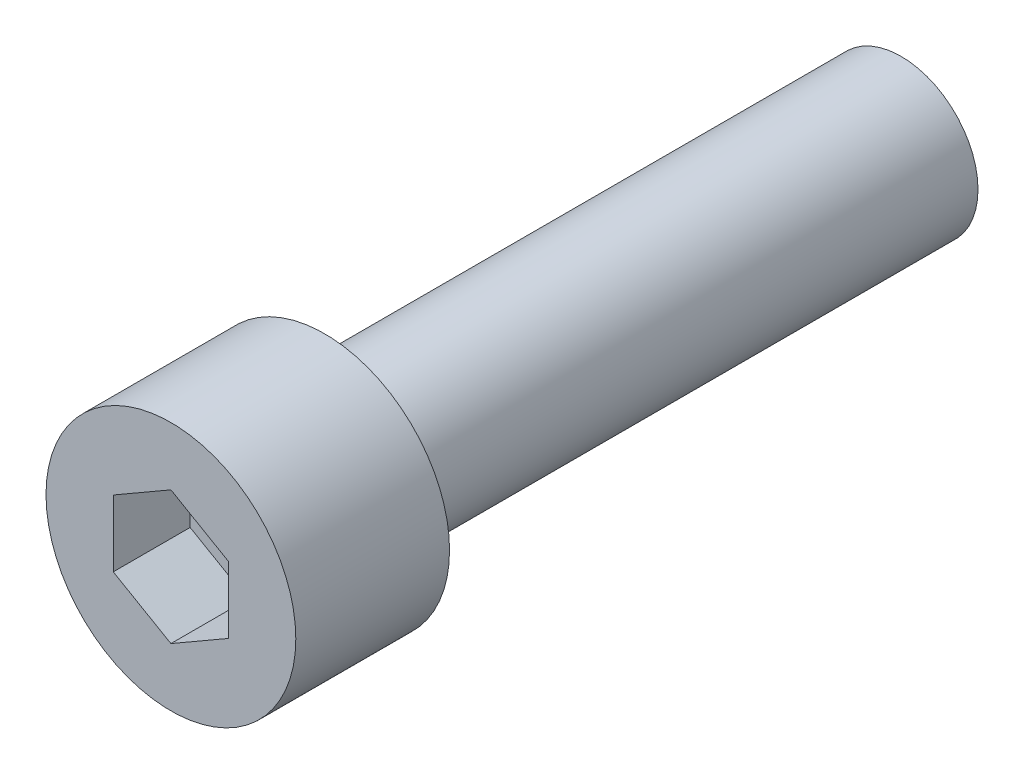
ISO-10303-21;
HEADER;
FILE_DESCRIPTION(('STEP AP214'),'2;1');
FILE_NAME('part.step','',(''),(''),'','','');
FILE_SCHEMA(('AUTOMOTIVE_DESIGN { 1 0 10303 214 1 1 1 1 }'));
ENDSEC;
DATA;
#1=APPLICATION_CONTEXT('core data for automotive mechanical design processes');
#2=APPLICATION_PROTOCOL_DEFINITION('international standard','automotive_design',2000,#1);
#3=PRODUCT_CONTEXT('',#1,'mechanical');
#4=PRODUCT('Part','Part','',(#3));
#5=PRODUCT_RELATED_PRODUCT_CATEGORY('part','',(#4));
#6=PRODUCT_DEFINITION_FORMATION('','',#4);
#7=PRODUCT_DEFINITION_CONTEXT('part definition',#1,'design');
#8=PRODUCT_DEFINITION('design','',#6,#7);
#9=PRODUCT_DEFINITION_SHAPE('','',#8);
#10=(LENGTH_UNIT() NAMED_UNIT(*) SI_UNIT(.MILLI.,.METRE.));
#11=(NAMED_UNIT(*) PLANE_ANGLE_UNIT() SI_UNIT($,.RADIAN.));
#12=(NAMED_UNIT(*) SI_UNIT($,.STERADIAN.) SOLID_ANGLE_UNIT());
#13=UNCERTAINTY_MEASURE_WITH_UNIT(LENGTH_MEASURE(1.E-05),#10,'distance_accuracy_value','');
#14=(GEOMETRIC_REPRESENTATION_CONTEXT(3) GLOBAL_UNCERTAINTY_ASSIGNED_CONTEXT((#13)) GLOBAL_UNIT_ASSIGNED_CONTEXT((#10,
#11,#12)) REPRESENTATION_CONTEXT('',''));
#15=CARTESIAN_POINT('',(0.,0.,0.));
#16=DIRECTION('',(0.,0.,1.));
#17=DIRECTION('',(1.,0.,0.));
#18=AXIS2_PLACEMENT_3D('',#15,#16,#17);
#19=CARTESIAN_POINT('',(0.,3.46410161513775,4.));
#20=DIRECTION('',(-0.5,-0.86602540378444,0.));
#21=DIRECTION('',(0.86602540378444,-0.5,0.));
#22=AXIS2_PLACEMENT_3D('',#19,#20,#21);
#23=PLANE('',#22);
#24=DIRECTION('',(0.,0.,1.));
#25=VECTOR('',#24,1.);
#26=CARTESIAN_POINT('',(3.,1.73205080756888,4.));
#27=LINE('',#26,#25);
#28=CARTESIAN_POINT('',(3.,1.73205080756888,4.));
#29=VERTEX_POINT('',#28);
#30=CARTESIAN_POINT('',(3.,1.73205080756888,8.));
#31=VERTEX_POINT('',#30);
#32=EDGE_CURVE('E64',#29,#31,#27,.T.);
#33=ORIENTED_EDGE('',*,*,#32,.T.);
#34=DIRECTION('',(0.86602540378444,-0.5,0.));
#35=VECTOR('',#34,1.);
#36=CARTESIAN_POINT('',(0.,3.46410161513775,8.));
#37=LINE('',#36,#35);
#38=CARTESIAN_POINT('',(0.,3.46410161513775,8.));
#39=VERTEX_POINT('',#38);
#40=EDGE_CURVE('E30',#39,#31,#37,.T.);
#41=ORIENTED_EDGE('',*,*,#40,.F.);
#42=DIRECTION('',(0.,0.,1.));
#43=VECTOR('',#42,1.);
#44=CARTESIAN_POINT('',(0.,3.46410161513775,4.));
#45=LINE('',#44,#43);
#46=CARTESIAN_POINT('',(0.,3.46410161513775,4.));
#47=VERTEX_POINT('',#46);
#48=EDGE_CURVE('E34',#47,#39,#45,.T.);
#49=ORIENTED_EDGE('',*,*,#48,.F.);
#50=DIRECTION('',(0.86602540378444,-0.5,0.));
#51=VECTOR('',#50,1.);
#52=CARTESIAN_POINT('',(0.,3.46410161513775,4.));
#53=LINE('',#52,#51);
#54=EDGE_CURVE('E66',#47,#29,#53,.T.);
#55=ORIENTED_EDGE('',*,*,#54,.T.);
#56=EDGE_LOOP('',(#33,#41,#49,#55));
#57=FACE_BOUND('',#56,.T.);
#58=ADVANCED_FACE('F15',(#57),#23,.T.);
#59=CARTESIAN_POINT('',(3.,-1.73205080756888,4.));
#60=DIRECTION('',(1.,0.,0.));
#61=DIRECTION('',(0.,0.,-1.));
#62=AXIS2_PLACEMENT_3D('',#59,#60,#61);
#63=PLANE('',#62);
#64=DIRECTION('',(0.,0.,1.));
#65=VECTOR('',#64,1.);
#66=CARTESIAN_POINT('',(3.,-1.73205080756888,4.));
#67=LINE('',#66,#65);
#68=CARTESIAN_POINT('',(3.,-1.73205080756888,4.));
#69=VERTEX_POINT('',#68);
#70=CARTESIAN_POINT('',(3.,-1.73205080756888,8.));
#71=VERTEX_POINT('',#70);
#72=EDGE_CURVE('E71',#69,#71,#67,.T.);
#73=ORIENTED_EDGE('',*,*,#72,.T.);
#74=DIRECTION('',(0.,1.,0.));
#75=VECTOR('',#74,1.);
#76=CARTESIAN_POINT('',(3.,-1.73205080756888,8.));
#77=LINE('',#76,#75);
#78=EDGE_CURVE('E74',#71,#31,#77,.T.);
#79=ORIENTED_EDGE('',*,*,#78,.T.);
#80=ORIENTED_EDGE('',*,*,#32,.F.);
#81=DIRECTION('',(0.,1.,0.));
#82=VECTOR('',#81,1.);
#83=CARTESIAN_POINT('',(3.,-1.73205080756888,4.));
#84=LINE('',#83,#82);
#85=EDGE_CURVE('E100',#69,#29,#84,.T.);
#86=ORIENTED_EDGE('',*,*,#85,.F.);
#87=EDGE_LOOP('',(#73,#79,#80,#86));
#88=FACE_BOUND('',#87,.T.);
#89=ADVANCED_FACE('F75',(#88),#63,.F.);
#90=CARTESIAN_POINT('',(0.,-3.46410161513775,4.));
#91=DIRECTION('',(0.5,-0.86602540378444,0.));
#92=DIRECTION('',(0.86602540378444,0.5,0.));
#93=AXIS2_PLACEMENT_3D('',#90,#91,#92);
#94=PLANE('',#93);
#95=DIRECTION('',(0.,0.,1.));
#96=VECTOR('',#95,1.);
#97=CARTESIAN_POINT('',(0.,-3.46410161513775,4.));
#98=LINE('',#97,#96);
#99=CARTESIAN_POINT('',(0.,-3.46410161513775,4.));
#100=VERTEX_POINT('',#99);
#101=CARTESIAN_POINT('',(0.,-3.46410161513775,8.));
#102=VERTEX_POINT('',#101);
#103=EDGE_CURVE('E108',#100,#102,#98,.T.);
#104=ORIENTED_EDGE('',*,*,#103,.T.);
#105=DIRECTION('',(0.86602540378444,0.5,0.));
#106=VECTOR('',#105,1.);
#107=CARTESIAN_POINT('',(0.,-3.46410161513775,8.));
#108=LINE('',#107,#106);
#109=EDGE_CURVE('E79',#102,#71,#108,.T.);
#110=ORIENTED_EDGE('',*,*,#109,.T.);
#111=ORIENTED_EDGE('',*,*,#72,.F.);
#112=DIRECTION('',(0.86602540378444,0.5,0.));
#113=VECTOR('',#112,1.);
#114=CARTESIAN_POINT('',(0.,-3.46410161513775,4.));
#115=LINE('',#114,#113);
#116=EDGE_CURVE('E97',#100,#69,#115,.T.);
#117=ORIENTED_EDGE('',*,*,#116,.F.);
#118=EDGE_LOOP('',(#104,#110,#111,#117));
#119=FACE_BOUND('',#118,.T.);
#120=ADVANCED_FACE('F141',(#119),#94,.F.);
#121=CARTESIAN_POINT('',(0.,-3.46410161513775,4.));
#122=DIRECTION('',(0.5,0.86602540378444,0.));
#123=DIRECTION('',(-0.86602540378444,0.5,0.));
#124=AXIS2_PLACEMENT_3D('',#121,#122,#123);
#125=PLANE('',#124);
#126=DIRECTION('',(0.,0.,1.));
#127=VECTOR('',#126,1.);
#128=CARTESIAN_POINT('',(-3.,-1.73205080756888,4.));
#129=LINE('',#128,#127);
#130=CARTESIAN_POINT('',(-3.,-1.73205080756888,4.));
#131=VERTEX_POINT('',#130);
#132=CARTESIAN_POINT('',(-3.,-1.73205080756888,8.));
#133=VERTEX_POINT('',#132);
#134=EDGE_CURVE('E106',#131,#133,#129,.T.);
#135=ORIENTED_EDGE('',*,*,#134,.T.);
#136=DIRECTION('',(-0.86602540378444,0.5,0.));
#137=VECTOR('',#136,1.);
#138=CARTESIAN_POINT('',(0.,-3.46410161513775,8.));
#139=LINE('',#138,#137);
#140=EDGE_CURVE('E249',#102,#133,#139,.T.);
#141=ORIENTED_EDGE('',*,*,#140,.F.);
#142=ORIENTED_EDGE('',*,*,#103,.F.);
#143=DIRECTION('',(-0.86602540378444,0.5,0.));
#144=VECTOR('',#143,1.);
#145=CARTESIAN_POINT('',(0.,-3.46410161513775,4.));
#146=LINE('',#145,#144);
#147=EDGE_CURVE('E94',#100,#131,#146,.T.);
#148=ORIENTED_EDGE('',*,*,#147,.T.);
#149=EDGE_LOOP('',(#135,#141,#142,#148));
#150=FACE_BOUND('',#149,.T.);
#151=ADVANCED_FACE('F153',(#150),#125,.T.);
#152=CARTESIAN_POINT('',(-3.,1.73205080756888,4.));
#153=DIRECTION('',(-1.,0.,0.));
#154=DIRECTION('',(0.,-1.,0.));
#155=AXIS2_PLACEMENT_3D('',#152,#153,#154);
#156=PLANE('',#155);
#157=DIRECTION('',(0.,0.,1.));
#158=VECTOR('',#157,1.);
#159=CARTESIAN_POINT('',(-3.,1.73205080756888,4.));
#160=LINE('',#159,#158);
#161=CARTESIAN_POINT('',(-3.,1.73205080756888,4.));
#162=VERTEX_POINT('',#161);
#163=CARTESIAN_POINT('',(-3.,1.73205080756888,8.));
#164=VERTEX_POINT('',#163);
#165=EDGE_CURVE('E104',#162,#164,#160,.T.);
#166=ORIENTED_EDGE('',*,*,#165,.T.);
#167=DIRECTION('',(0.,-1.,0.));
#168=VECTOR('',#167,1.);
#169=CARTESIAN_POINT('',(-3.,1.73205080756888,8.));
#170=LINE('',#169,#168);
#171=EDGE_CURVE('E250',#164,#133,#170,.T.);
#172=ORIENTED_EDGE('',*,*,#171,.T.);
#173=ORIENTED_EDGE('',*,*,#134,.F.);
#174=DIRECTION('',(0.,-1.,0.));
#175=VECTOR('',#174,1.);
#176=CARTESIAN_POINT('',(-3.,1.73205080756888,4.));
#177=LINE('',#176,#175);
#178=EDGE_CURVE('E91',#162,#131,#177,.T.);
#179=ORIENTED_EDGE('',*,*,#178,.F.);
#180=EDGE_LOOP('',(#166,#172,#173,#179));
#181=FACE_BOUND('',#180,.T.);
#182=ADVANCED_FACE('F149',(#181),#156,.F.);
#183=CARTESIAN_POINT('',(0.,3.46410161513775,4.));
#184=DIRECTION('',(-0.5,0.86602540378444,0.));
#185=DIRECTION('',(-0.86602540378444,-0.5,0.));
#186=AXIS2_PLACEMENT_3D('',#183,#184,#185);
#187=PLANE('',#186);
#188=DIRECTION('',(-0.86602540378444,-0.5,0.));
#189=VECTOR('',#188,1.);
#190=CARTESIAN_POINT('',(0.,3.46410161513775,4.));
#191=LINE('',#190,#189);
#192=EDGE_CURVE('E88',#47,#162,#191,.T.);
#193=ORIENTED_EDGE('',*,*,#192,.F.);
#194=ORIENTED_EDGE('',*,*,#48,.T.);
#195=DIRECTION('',(-0.86602540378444,-0.5,0.));
#196=VECTOR('',#195,1.);
#197=CARTESIAN_POINT('',(0.,3.46410161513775,8.));
#198=LINE('',#197,#196);
#199=EDGE_CURVE('E84',#39,#164,#198,.T.);
#200=ORIENTED_EDGE('',*,*,#199,.T.);
#201=ORIENTED_EDGE('',*,*,#165,.F.);
#202=EDGE_LOOP('',(#193,#194,#200,#201));
#203=FACE_BOUND('',#202,.T.);
#204=ADVANCED_FACE('F146',(#203),#187,.F.);
#205=CARTESIAN_POINT('',(-3.,5.19615242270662,4.));
#206=DIRECTION('',(0.,0.,-1.));
#207=DIRECTION('',(-1.,0.,0.));
#208=AXIS2_PLACEMENT_3D('',#205,#206,#207);
#209=PLANE('',#208);
#210=ORIENTED_EDGE('',*,*,#54,.F.);
#211=ORIENTED_EDGE('',*,*,#192,.T.);
#212=ORIENTED_EDGE('',*,*,#178,.T.);
#213=ORIENTED_EDGE('',*,*,#147,.F.);
#214=ORIENTED_EDGE('',*,*,#116,.T.);
#215=ORIENTED_EDGE('',*,*,#85,.T.);
#216=EDGE_LOOP('',(#210,#211,#212,#213,#214,#215));
#217=FACE_BOUND('',#216,.T.);
#218=ADVANCED_FACE('F145',(#217),#209,.F.);
#219=CARTESIAN_POINT('',(0.,0.,8.));
#220=DIRECTION('',(0.,0.,1.));
#221=DIRECTION('',(1.,0.,0.));
#222=AXIS2_PLACEMENT_3D('',#219,#220,#221);
#223=PLANE('',#222);
#224=CARTESIAN_POINT('',(0.,0.,8.));
#225=DIRECTION('',(0.,0.,1.));
#226=DIRECTION('',(1.,0.,0.));
#227=AXIS2_PLACEMENT_3D('',#224,#225,#226);
#228=CIRCLE('',#227,6.5);
#229=CARTESIAN_POINT('',(6.5,0.,8.));
#230=VERTEX_POINT('',#229);
#231=EDGE_CURVE('E9',#230,#230,#228,.T.);
#232=ORIENTED_EDGE('',*,*,#231,.T.);
#233=EDGE_LOOP('',(#232));
#234=FACE_BOUND('',#233,.T.);
#235=ORIENTED_EDGE('',*,*,#199,.F.);
#236=ORIENTED_EDGE('',*,*,#40,.T.);
#237=ORIENTED_EDGE('',*,*,#78,.F.);
#238=ORIENTED_EDGE('',*,*,#109,.F.);
#239=ORIENTED_EDGE('',*,*,#140,.T.);
#240=ORIENTED_EDGE('',*,*,#171,.F.);
#241=EDGE_LOOP('',(#235,#236,#237,#238,#239,#240));
#242=FACE_BOUND('',#241,.T.);
#243=ADVANCED_FACE('F17',(#234,#242),#223,.T.);
#244=CARTESIAN_POINT('',(0.,0.,-10.));
#245=DIRECTION('',(0.,0.,1.));
#246=DIRECTION('',(1.,0.,0.));
#247=AXIS2_PLACEMENT_3D('',#244,#245,#246);
#248=CYLINDRICAL_SURFACE('',#247,6.5);
#249=CARTESIAN_POINT('',(0.,0.,0.));
#250=DIRECTION('',(0.,0.,1.));
#251=DIRECTION('',(1.,0.,0.));
#252=AXIS2_PLACEMENT_3D('',#249,#250,#251);
#253=CIRCLE('',#252,6.5);
#254=CARTESIAN_POINT('',(6.5,0.,0.));
#255=VERTEX_POINT('',#254);
#256=EDGE_CURVE('E23',#255,#255,#253,.T.);
#257=ORIENTED_EDGE('',*,*,#256,.T.);
#258=EDGE_LOOP('',(#257));
#259=FACE_BOUND('',#258,.T.);
#260=ORIENTED_EDGE('',*,*,#231,.F.);
#261=EDGE_LOOP('',(#260));
#262=FACE_BOUND('',#261,.T.);
#263=ADVANCED_FACE('F118',(#259,#262),#248,.T.);
#264=CARTESIAN_POINT('',(6.5,0.,0.));
#265=DIRECTION('',(0.,0.,-1.));
#266=DIRECTION('',(-1.,0.,0.));
#267=AXIS2_PLACEMENT_3D('',#264,#265,#266);
#268=PLANE('',#267);
#269=CARTESIAN_POINT('',(0.,0.,0.));
#270=DIRECTION('',(0.,0.,1.));
#271=DIRECTION('',(1.,0.,0.));
#272=AXIS2_PLACEMENT_3D('',#269,#270,#271);
#273=CIRCLE('',#272,4.);
#274=CARTESIAN_POINT('',(4.,0.,0.));
#275=VERTEX_POINT('',#274);
#276=EDGE_CURVE('E113',#275,#275,#273,.T.);
#277=ORIENTED_EDGE('',*,*,#276,.T.);
#278=EDGE_LOOP('',(#277));
#279=FACE_BOUND('',#278,.T.);
#280=ORIENTED_EDGE('',*,*,#256,.F.);
#281=EDGE_LOOP('',(#280));
#282=FACE_BOUND('',#281,.T.);
#283=ADVANCED_FACE('F121',(#279,#282),#268,.T.);
#284=CARTESIAN_POINT('',(0.,0.,-10.));
#285=DIRECTION('',(0.,0.,1.));
#286=DIRECTION('',(1.,0.,0.));
#287=AXIS2_PLACEMENT_3D('',#284,#285,#286);
#288=CYLINDRICAL_SURFACE('',#287,4.);
#289=CARTESIAN_POINT('',(0.,0.,-30.));
#290=DIRECTION('',(0.,0.,1.));
#291=DIRECTION('',(1.,0.,0.));
#292=AXIS2_PLACEMENT_3D('',#289,#290,#291);
#293=CIRCLE('',#292,4.);
#294=CARTESIAN_POINT('',(4.,0.,-30.));
#295=VERTEX_POINT('',#294);
#296=EDGE_CURVE('E70',#295,#295,#293,.T.);
#297=ORIENTED_EDGE('',*,*,#296,.T.);
#298=EDGE_LOOP('',(#297));
#299=FACE_BOUND('',#298,.T.);
#300=ORIENTED_EDGE('',*,*,#276,.F.);
#301=EDGE_LOOP('',(#300));
#302=FACE_BOUND('',#301,.T.);
#303=ADVANCED_FACE('F123',(#299,#302),#288,.T.);
#304=CARTESIAN_POINT('',(4.,0.,-30.));
#305=DIRECTION('',(0.,0.,-1.));
#306=DIRECTION('',(-1.,0.,0.));
#307=AXIS2_PLACEMENT_3D('',#304,#305,#306);
#308=PLANE('',#307);
#309=ORIENTED_EDGE('',*,*,#296,.F.);
#310=EDGE_LOOP('',(#309));
#311=FACE_BOUND('',#310,.T.);
#312=ADVANCED_FACE('F132',(#311),#308,.T.);
#313=CLOSED_SHELL('',(#58,#89,#120,#151,#182,#204,#218,#243,#263,#283,#303,#312));
#314=MANIFOLD_SOLID_BREP('B1',#313);
#315=ADVANCED_BREP_SHAPE_REPRESENTATION('',(#18,#314),#14);
#316=SHAPE_DEFINITION_REPRESENTATION(#9,#315);
ENDSEC;
END-ISO-10303-21;
